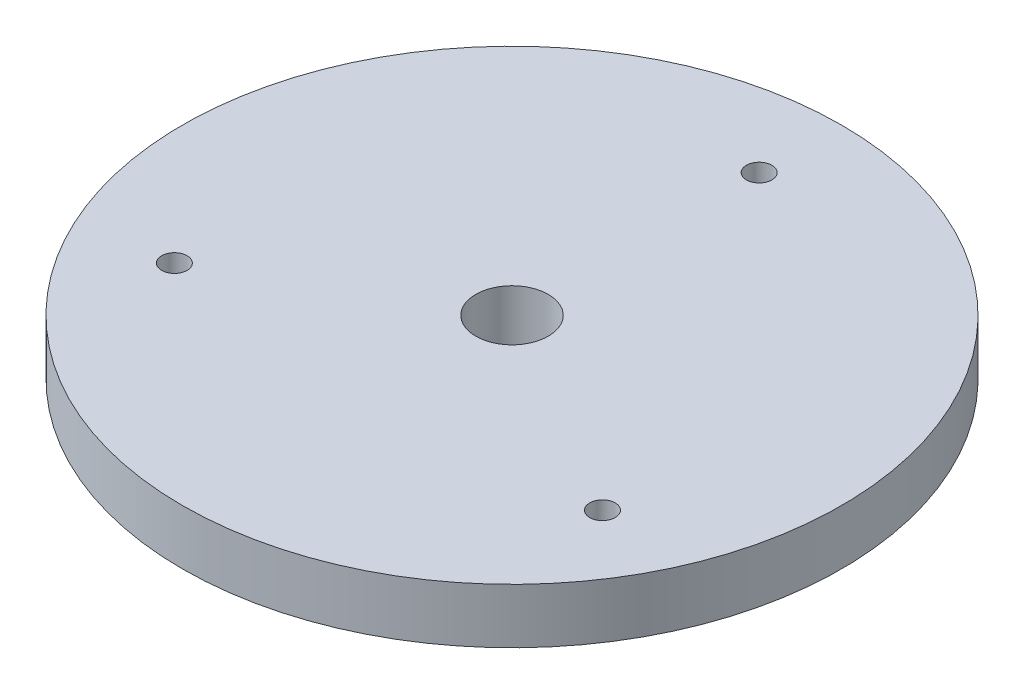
ISO-10303-21;
HEADER;
FILE_DESCRIPTION(('STEP AP214'),'2;1');
FILE_NAME('part.step','',(''),(''),'','','');
FILE_SCHEMA(('AUTOMOTIVE_DESIGN { 1 0 10303 214 1 1 1 1 }'));
ENDSEC;
DATA;
#1=APPLICATION_CONTEXT('core data for automotive mechanical design processes');
#2=APPLICATION_PROTOCOL_DEFINITION('international standard','automotive_design',2000,#1);
#3=PRODUCT_CONTEXT('',#1,'mechanical');
#4=PRODUCT('Part','Part','',(#3));
#5=PRODUCT_RELATED_PRODUCT_CATEGORY('part','',(#4));
#6=PRODUCT_DEFINITION_FORMATION('','',#4);
#7=PRODUCT_DEFINITION_CONTEXT('part definition',#1,'design');
#8=PRODUCT_DEFINITION('design','',#6,#7);
#9=PRODUCT_DEFINITION_SHAPE('','',#8);
#10=(LENGTH_UNIT() NAMED_UNIT(*) SI_UNIT(.MILLI.,.METRE.));
#11=(NAMED_UNIT(*) PLANE_ANGLE_UNIT() SI_UNIT($,.RADIAN.));
#12=(NAMED_UNIT(*) SI_UNIT($,.STERADIAN.) SOLID_ANGLE_UNIT());
#13=UNCERTAINTY_MEASURE_WITH_UNIT(LENGTH_MEASURE(1.E-05),#10,'distance_accuracy_value','');
#14=(GEOMETRIC_REPRESENTATION_CONTEXT(3) GLOBAL_UNCERTAINTY_ASSIGNED_CONTEXT((#13)) GLOBAL_UNIT_ASSIGNED_CONTEXT((#10,
#11,#12)) REPRESENTATION_CONTEXT('',''));
#15=CARTESIAN_POINT('',(0.,0.,0.));
#16=DIRECTION('',(0.,0.,1.));
#17=DIRECTION('',(1.,0.,0.));
#18=AXIS2_PLACEMENT_3D('',#15,#16,#17);
#19=CARTESIAN_POINT('',(0.,6.35,0.));
#20=DIRECTION('',(0.,1.,0.));
#21=DIRECTION('',(0.,0.,1.));
#22=AXIS2_PLACEMENT_3D('',#19,#20,#21);
#23=PLANE('',#22);
#24=CARTESIAN_POINT('',(-24.7466759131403,6.35,14.2875));
#25=DIRECTION('',(0.,1.,0.));
#26=DIRECTION('',(0.,0.,1.));
#27=AXIS2_PLACEMENT_3D('',#24,#25,#26);
#28=CIRCLE('',#27,1.4732);
#29=CARTESIAN_POINT('',(-24.7466759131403,6.35,15.7607));
#30=VERTEX_POINT('',#29);
#31=EDGE_CURVE('E57',#30,#30,#28,.T.);
#32=ORIENTED_EDGE('',*,*,#31,.F.);
#33=EDGE_LOOP('',(#32));
#34=FACE_BOUND('',#33,.T.);
#35=CARTESIAN_POINT('',(0.,6.35,-28.575));
#36=DIRECTION('',(0.,1.,0.));
#37=DIRECTION('',(0.,0.,1.));
#38=AXIS2_PLACEMENT_3D('',#35,#36,#37);
#39=CIRCLE('',#38,1.4732);
#40=CARTESIAN_POINT('',(0.,6.35,-27.1018));
#41=VERTEX_POINT('',#40);
#42=EDGE_CURVE('E46',#41,#41,#39,.T.);
#43=ORIENTED_EDGE('',*,*,#42,.F.);
#44=EDGE_LOOP('',(#43));
#45=FACE_BOUND('',#44,.T.);
#46=CARTESIAN_POINT('',(0.,6.35,0.));
#47=DIRECTION('',(0.,1.,0.));
#48=DIRECTION('',(0.,0.,1.));
#49=AXIS2_PLACEMENT_3D('',#46,#47,#48);
#50=CIRCLE('',#49,38.1);
#51=CARTESIAN_POINT('',(0.,6.35,38.1));
#52=VERTEX_POINT('',#51);
#53=EDGE_CURVE('E10',#52,#52,#50,.T.);
#54=ORIENTED_EDGE('',*,*,#53,.T.);
#55=EDGE_LOOP('',(#54));
#56=FACE_BOUND('',#55,.T.);
#57=CARTESIAN_POINT('',(24.7466759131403,6.35,14.2875));
#58=DIRECTION('',(0.,1.,0.));
#59=DIRECTION('',(0.,0.,1.));
#60=AXIS2_PLACEMENT_3D('',#57,#58,#59);
#61=CIRCLE('',#60,1.4732);
#62=CARTESIAN_POINT('',(24.7466759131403,6.35,15.7607));
#63=VERTEX_POINT('',#62);
#64=EDGE_CURVE('E51',#63,#63,#61,.T.);
#65=ORIENTED_EDGE('',*,*,#64,.F.);
#66=EDGE_LOOP('',(#65));
#67=FACE_BOUND('',#66,.T.);
#68=CARTESIAN_POINT('',(0.,6.35,0.));
#69=DIRECTION('',(0.,1.,0.));
#70=DIRECTION('',(0.,0.,1.));
#71=AXIS2_PLACEMENT_3D('',#68,#69,#70);
#72=CIRCLE('',#71,4.191);
#73=CARTESIAN_POINT('',(0.,6.35,4.191));
#74=VERTEX_POINT('',#73);
#75=EDGE_CURVE('E63',#74,#74,#72,.T.);
#76=ORIENTED_EDGE('',*,*,#75,.F.);
#77=EDGE_LOOP('',(#76));
#78=FACE_BOUND('',#77,.T.);
#79=ADVANCED_FACE('F35',(#34,#45,#56,#67,#78),#23,.T.);
#80=CARTESIAN_POINT('',(0.,0.,0.));
#81=DIRECTION('',(0.,1.,0.));
#82=DIRECTION('',(0.,0.,1.));
#83=AXIS2_PLACEMENT_3D('',#80,#81,#82);
#84=PLANE('',#83);
#85=CARTESIAN_POINT('',(0.,0.,0.));
#86=DIRECTION('',(0.,1.,0.));
#87=DIRECTION('',(0.,0.,1.));
#88=AXIS2_PLACEMENT_3D('',#85,#86,#87);
#89=CIRCLE('',#88,38.1);
#90=CARTESIAN_POINT('',(0.,0.,38.1));
#91=VERTEX_POINT('',#90);
#92=EDGE_CURVE('E39',#91,#91,#89,.T.);
#93=ORIENTED_EDGE('',*,*,#92,.F.);
#94=EDGE_LOOP('',(#93));
#95=FACE_BOUND('',#94,.T.);
#96=CARTESIAN_POINT('',(0.,0.,-28.575));
#97=DIRECTION('',(0.,1.,0.));
#98=DIRECTION('',(0.,0.,1.));
#99=AXIS2_PLACEMENT_3D('',#96,#97,#98);
#100=CIRCLE('',#99,1.4732);
#101=CARTESIAN_POINT('',(0.,0.,-27.1018));
#102=VERTEX_POINT('',#101);
#103=EDGE_CURVE('E48',#102,#102,#100,.T.);
#104=ORIENTED_EDGE('',*,*,#103,.T.);
#105=EDGE_LOOP('',(#104));
#106=FACE_BOUND('',#105,.T.);
#107=CARTESIAN_POINT('',(24.7466759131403,0.,14.2875));
#108=DIRECTION('',(0.,1.,0.));
#109=DIRECTION('',(0.,0.,1.));
#110=AXIS2_PLACEMENT_3D('',#107,#108,#109);
#111=CIRCLE('',#110,1.4732);
#112=CARTESIAN_POINT('',(24.7466759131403,0.,15.7607));
#113=VERTEX_POINT('',#112);
#114=EDGE_CURVE('E54',#113,#113,#111,.T.);
#115=ORIENTED_EDGE('',*,*,#114,.T.);
#116=EDGE_LOOP('',(#115));
#117=FACE_BOUND('',#116,.T.);
#118=CARTESIAN_POINT('',(-24.7466759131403,0.,14.2875));
#119=DIRECTION('',(0.,1.,0.));
#120=DIRECTION('',(0.,0.,1.));
#121=AXIS2_PLACEMENT_3D('',#118,#119,#120);
#122=CIRCLE('',#121,1.4732);
#123=CARTESIAN_POINT('',(-24.7466759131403,0.,15.7607));
#124=VERTEX_POINT('',#123);
#125=EDGE_CURVE('E60',#124,#124,#122,.T.);
#126=ORIENTED_EDGE('',*,*,#125,.T.);
#127=EDGE_LOOP('',(#126));
#128=FACE_BOUND('',#127,.T.);
#129=CARTESIAN_POINT('',(0.,0.,0.));
#130=DIRECTION('',(0.,1.,0.));
#131=DIRECTION('',(0.,0.,1.));
#132=AXIS2_PLACEMENT_3D('',#129,#130,#131);
#133=CIRCLE('',#132,4.191);
#134=CARTESIAN_POINT('',(0.,0.,4.191));
#135=VERTEX_POINT('',#134);
#136=EDGE_CURVE('E66',#135,#135,#133,.T.);
#137=ORIENTED_EDGE('',*,*,#136,.T.);
#138=EDGE_LOOP('',(#137));
#139=FACE_BOUND('',#138,.T.);
#140=ADVANCED_FACE('F76',(#95,#106,#117,#128,#139),#84,.F.);
#141=CARTESIAN_POINT('',(0.,6.35,0.));
#142=DIRECTION('',(0.,-1.,0.));
#143=DIRECTION('',(0.,0.,-1.));
#144=AXIS2_PLACEMENT_3D('',#141,#142,#143);
#145=CYLINDRICAL_SURFACE('',#144,38.1);
#146=ORIENTED_EDGE('',*,*,#53,.F.);
#147=EDGE_LOOP('',(#146));
#148=FACE_BOUND('',#147,.T.);
#149=ORIENTED_EDGE('',*,*,#92,.T.);
#150=EDGE_LOOP('',(#149));
#151=FACE_BOUND('',#150,.T.);
#152=ADVANCED_FACE('F37',(#148,#151),#145,.T.);
#153=CARTESIAN_POINT('',(0.,6.35,-28.575));
#154=DIRECTION('',(0.,-1.,0.));
#155=DIRECTION('',(0.,0.,-1.));
#156=AXIS2_PLACEMENT_3D('',#153,#154,#155);
#157=CYLINDRICAL_SURFACE('',#156,1.4732);
#158=ORIENTED_EDGE('',*,*,#42,.T.);
#159=EDGE_LOOP('',(#158));
#160=FACE_BOUND('',#159,.T.);
#161=ORIENTED_EDGE('',*,*,#103,.F.);
#162=EDGE_LOOP('',(#161));
#163=FACE_BOUND('',#162,.T.);
#164=ADVANCED_FACE('F86',(#160,#163),#157,.F.);
#165=CARTESIAN_POINT('',(24.7466759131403,6.35,14.2875));
#166=DIRECTION('',(0.,-1.,0.));
#167=DIRECTION('',(0.,0.,-1.));
#168=AXIS2_PLACEMENT_3D('',#165,#166,#167);
#169=CYLINDRICAL_SURFACE('',#168,1.4732);
#170=ORIENTED_EDGE('',*,*,#64,.T.);
#171=EDGE_LOOP('',(#170));
#172=FACE_BOUND('',#171,.T.);
#173=ORIENTED_EDGE('',*,*,#114,.F.);
#174=EDGE_LOOP('',(#173));
#175=FACE_BOUND('',#174,.T.);
#176=ADVANCED_FACE('F89',(#172,#175),#169,.F.);
#177=CARTESIAN_POINT('',(-24.7466759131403,6.35,14.2875));
#178=DIRECTION('',(0.,-1.,0.));
#179=DIRECTION('',(0.,0.,-1.));
#180=AXIS2_PLACEMENT_3D('',#177,#178,#179);
#181=CYLINDRICAL_SURFACE('',#180,1.4732);
#182=ORIENTED_EDGE('',*,*,#31,.T.);
#183=EDGE_LOOP('',(#182));
#184=FACE_BOUND('',#183,.T.);
#185=ORIENTED_EDGE('',*,*,#125,.F.);
#186=EDGE_LOOP('',(#185));
#187=FACE_BOUND('',#186,.T.);
#188=ADVANCED_FACE('F93',(#184,#187),#181,.F.);
#189=CARTESIAN_POINT('',(0.,6.35,0.));
#190=DIRECTION('',(0.,-1.,0.));
#191=DIRECTION('',(0.,0.,-1.));
#192=AXIS2_PLACEMENT_3D('',#189,#190,#191);
#193=CYLINDRICAL_SURFACE('',#192,4.191);
#194=ORIENTED_EDGE('',*,*,#75,.T.);
#195=EDGE_LOOP('',(#194));
#196=FACE_BOUND('',#195,.T.);
#197=ORIENTED_EDGE('',*,*,#136,.F.);
#198=EDGE_LOOP('',(#197));
#199=FACE_BOUND('',#198,.T.);
#200=ADVANCED_FACE('F72',(#196,#199),#193,.F.);
#201=CLOSED_SHELL('',(#79,#140,#152,#164,#176,#188,#200));
#202=MANIFOLD_SOLID_BREP('B2',#201);
#203=ADVANCED_BREP_SHAPE_REPRESENTATION('',(#18,#202),#14);
#204=SHAPE_DEFINITION_REPRESENTATION(#9,#203);
ENDSEC;
END-ISO-10303-21;
